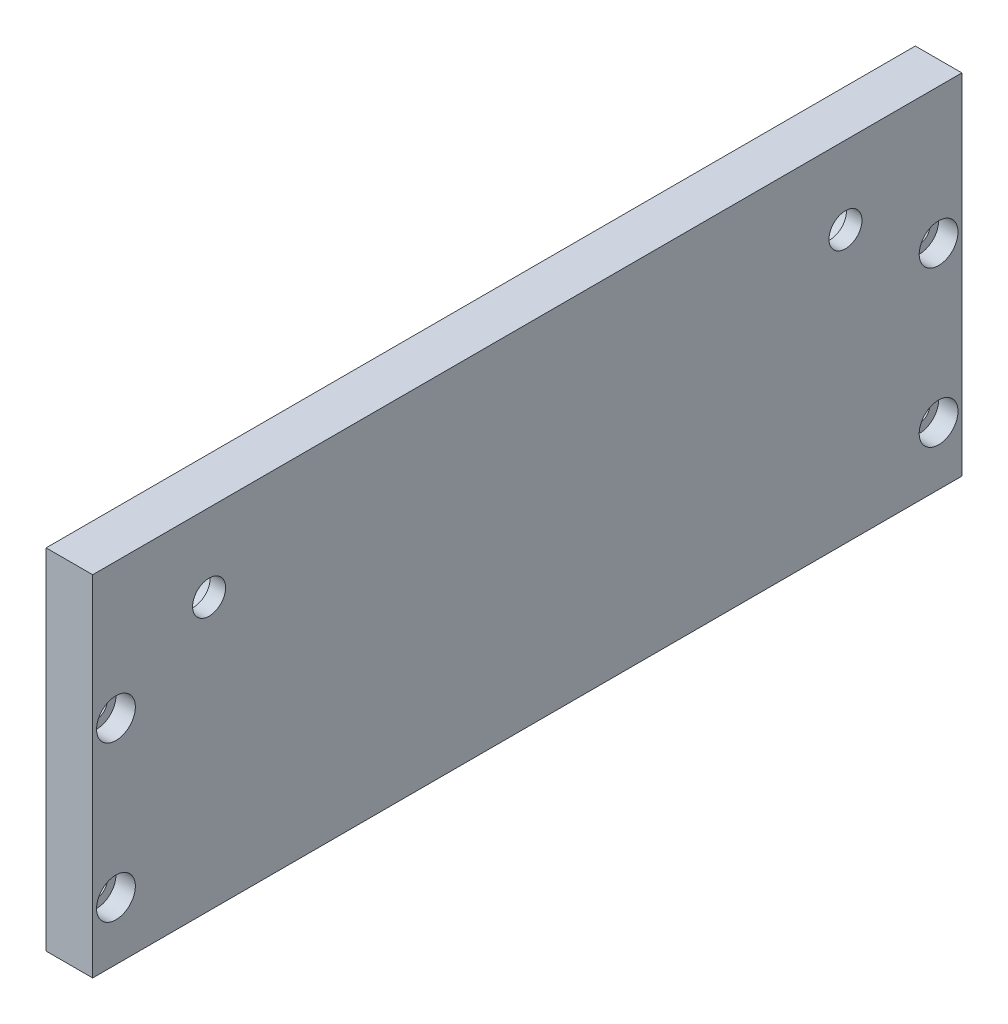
ISO-10303-21;
HEADER;
FILE_DESCRIPTION(('STEP AP214'),'2;1');
FILE_NAME('part.step','',(''),(''),'','','');
FILE_SCHEMA(('AUTOMOTIVE_DESIGN { 1 0 10303 214 1 1 1 1 }'));
ENDSEC;
DATA;
#1=APPLICATION_CONTEXT('core data for automotive mechanical design processes');
#2=APPLICATION_PROTOCOL_DEFINITION('international standard','automotive_design',2000,#1);
#3=PRODUCT_CONTEXT('',#1,'mechanical');
#4=PRODUCT('Part','Part','',(#3));
#5=PRODUCT_RELATED_PRODUCT_CATEGORY('part','',(#4));
#6=PRODUCT_DEFINITION_FORMATION('','',#4);
#7=PRODUCT_DEFINITION_CONTEXT('part definition',#1,'design');
#8=PRODUCT_DEFINITION('design','',#6,#7);
#9=PRODUCT_DEFINITION_SHAPE('','',#8);
#10=(LENGTH_UNIT() NAMED_UNIT(*) SI_UNIT(.MILLI.,.METRE.));
#11=(NAMED_UNIT(*) PLANE_ANGLE_UNIT() SI_UNIT($,.RADIAN.));
#12=(NAMED_UNIT(*) SI_UNIT($,.STERADIAN.) SOLID_ANGLE_UNIT());
#13=UNCERTAINTY_MEASURE_WITH_UNIT(LENGTH_MEASURE(1.E-05),#10,'distance_accuracy_value','');
#14=(GEOMETRIC_REPRESENTATION_CONTEXT(3) GLOBAL_UNCERTAINTY_ASSIGNED_CONTEXT((#13)) GLOBAL_UNIT_ASSIGNED_CONTEXT((#10,
#11,#12)) REPRESENTATION_CONTEXT('',''));
#15=CARTESIAN_POINT('',(0.,0.,0.));
#16=DIRECTION('',(0.,0.,1.));
#17=DIRECTION('',(1.,0.,0.));
#18=AXIS2_PLACEMENT_3D('',#15,#16,#17);
#19=CARTESIAN_POINT('',(7.,-30.,-106.));
#20=DIRECTION('',(1.,0.,0.));
#21=DIRECTION('',(0.,0.,-1.));
#22=AXIS2_PLACEMENT_3D('',#19,#20,#21);
#23=CYLINDRICAL_SURFACE('',#22,5.);
#24=CARTESIAN_POINT('',(12.,-30.,-106.));
#25=DIRECTION('',(1.,0.,0.));
#26=DIRECTION('',(0.,0.,-1.));
#27=AXIS2_PLACEMENT_3D('',#24,#25,#26);
#28=CIRCLE('',#27,5.);
#29=CARTESIAN_POINT('',(12.,-30.,-111.));
#30=VERTEX_POINT('',#29);
#31=EDGE_CURVE('E131',#30,#30,#28,.F.);
#32=ORIENTED_EDGE('',*,*,#31,.F.);
#33=EDGE_LOOP('',(#32));
#34=FACE_BOUND('',#33,.T.);
#35=CARTESIAN_POINT('',(7.,-30.,-106.));
#36=DIRECTION('',(1.,0.,0.));
#37=DIRECTION('',(0.,0.,-1.));
#38=AXIS2_PLACEMENT_3D('',#35,#36,#37);
#39=CIRCLE('',#38,5.);
#40=CARTESIAN_POINT('',(7.,-30.,-111.));
#41=VERTEX_POINT('',#40);
#42=EDGE_CURVE('E143',#41,#41,#39,.T.);
#43=ORIENTED_EDGE('',*,*,#42,.F.);
#44=EDGE_LOOP('',(#43));
#45=FACE_BOUND('',#44,.T.);
#46=ADVANCED_FACE('F17',(#34,#45),#23,.F.);
#47=CARTESIAN_POINT('',(7.,10.,-106.));
#48=DIRECTION('',(1.,0.,0.));
#49=DIRECTION('',(0.,0.,-1.));
#50=AXIS2_PLACEMENT_3D('',#47,#48,#49);
#51=CYLINDRICAL_SURFACE('',#50,5.);
#52=CARTESIAN_POINT('',(12.,10.,-106.));
#53=DIRECTION('',(1.,0.,0.));
#54=DIRECTION('',(0.,0.,-1.));
#55=AXIS2_PLACEMENT_3D('',#52,#53,#54);
#56=CIRCLE('',#55,5.);
#57=CARTESIAN_POINT('',(12.,10.,-111.));
#58=VERTEX_POINT('',#57);
#59=EDGE_CURVE('E128',#58,#58,#56,.F.);
#60=ORIENTED_EDGE('',*,*,#59,.F.);
#61=EDGE_LOOP('',(#60));
#62=FACE_BOUND('',#61,.T.);
#63=CARTESIAN_POINT('',(7.,10.,-106.));
#64=DIRECTION('',(1.,0.,0.));
#65=DIRECTION('',(0.,0.,-1.));
#66=AXIS2_PLACEMENT_3D('',#63,#64,#65);
#67=CIRCLE('',#66,5.);
#68=CARTESIAN_POINT('',(7.,10.,-111.));
#69=VERTEX_POINT('',#68);
#70=EDGE_CURVE('E145',#69,#69,#67,.T.);
#71=ORIENTED_EDGE('',*,*,#70,.F.);
#72=EDGE_LOOP('',(#71));
#73=FACE_BOUND('',#72,.T.);
#74=ADVANCED_FACE('F244',(#62,#73),#51,.F.);
#75=CARTESIAN_POINT('',(12.,25.,82.));
#76=DIRECTION('',(-1.,0.,0.));
#77=DIRECTION('',(0.,0.,1.));
#78=AXIS2_PLACEMENT_3D('',#75,#76,#77);
#79=CYLINDRICAL_SURFACE('',#78,4.25);
#80=CARTESIAN_POINT('',(8.,25.,82.));
#81=DIRECTION('',(-1.,0.,0.));
#82=DIRECTION('',(0.,0.,1.));
#83=AXIS2_PLACEMENT_3D('',#80,#81,#82);
#84=CIRCLE('',#83,4.25);
#85=CARTESIAN_POINT('',(8.,25.,86.25));
#86=VERTEX_POINT('',#85);
#87=EDGE_CURVE('E140',#86,#86,#84,.F.);
#88=ORIENTED_EDGE('',*,*,#87,.F.);
#89=EDGE_LOOP('',(#88));
#90=FACE_BOUND('',#89,.T.);
#91=CARTESIAN_POINT('',(12.,25.,82.));
#92=DIRECTION('',(-1.,0.,0.));
#93=DIRECTION('',(0.,0.,1.));
#94=AXIS2_PLACEMENT_3D('',#91,#92,#93);
#95=CIRCLE('',#94,4.25);
#96=CARTESIAN_POINT('',(12.,25.,86.25));
#97=VERTEX_POINT('',#96);
#98=EDGE_CURVE('E125',#97,#97,#95,.T.);
#99=ORIENTED_EDGE('',*,*,#98,.F.);
#100=EDGE_LOOP('',(#99));
#101=FACE_BOUND('',#100,.T.);
#102=ADVANCED_FACE('F241',(#90,#101),#79,.F.);
#103=CARTESIAN_POINT('',(12.,25.,-82.));
#104=DIRECTION('',(-1.,0.,0.));
#105=DIRECTION('',(0.,0.,1.));
#106=AXIS2_PLACEMENT_3D('',#103,#104,#105);
#107=CYLINDRICAL_SURFACE('',#106,4.25);
#108=CARTESIAN_POINT('',(8.,25.,-82.));
#109=DIRECTION('',(-1.,0.,0.));
#110=DIRECTION('',(0.,0.,1.));
#111=AXIS2_PLACEMENT_3D('',#108,#109,#110);
#112=CIRCLE('',#111,4.25);
#113=CARTESIAN_POINT('',(8.,25.,-77.75));
#114=VERTEX_POINT('',#113);
#115=EDGE_CURVE('E137',#114,#114,#112,.F.);
#116=ORIENTED_EDGE('',*,*,#115,.F.);
#117=EDGE_LOOP('',(#116));
#118=FACE_BOUND('',#117,.T.);
#119=CARTESIAN_POINT('',(12.,25.,-82.));
#120=DIRECTION('',(-1.,0.,0.));
#121=DIRECTION('',(0.,0.,1.));
#122=AXIS2_PLACEMENT_3D('',#119,#120,#121);
#123=CIRCLE('',#122,4.25);
#124=CARTESIAN_POINT('',(12.,25.,-77.75));
#125=VERTEX_POINT('',#124);
#126=EDGE_CURVE('E122',#125,#125,#123,.T.);
#127=ORIENTED_EDGE('',*,*,#126,.F.);
#128=EDGE_LOOP('',(#127));
#129=FACE_BOUND('',#128,.T.);
#130=ADVANCED_FACE('F159',(#118,#129),#107,.F.);
#131=CARTESIAN_POINT('',(7.,-30.,106.));
#132=DIRECTION('',(1.,0.,0.));
#133=DIRECTION('',(0.,0.,-1.));
#134=AXIS2_PLACEMENT_3D('',#131,#132,#133);
#135=CYLINDRICAL_SURFACE('',#134,5.);
#136=CARTESIAN_POINT('',(7.,-30.,106.));
#137=DIRECTION('',(1.,0.,0.));
#138=DIRECTION('',(0.,0.,-1.));
#139=AXIS2_PLACEMENT_3D('',#136,#137,#138);
#140=CIRCLE('',#139,5.);
#141=CARTESIAN_POINT('',(7.,-30.,101.));
#142=VERTEX_POINT('',#141);
#143=EDGE_CURVE('E20',#142,#142,#140,.T.);
#144=ORIENTED_EDGE('',*,*,#143,.F.);
#145=EDGE_LOOP('',(#144));
#146=FACE_BOUND('',#145,.T.);
#147=CARTESIAN_POINT('',(12.,-30.,106.));
#148=DIRECTION('',(1.,0.,0.));
#149=DIRECTION('',(0.,0.,-1.));
#150=AXIS2_PLACEMENT_3D('',#147,#148,#149);
#151=CIRCLE('',#150,5.);
#152=CARTESIAN_POINT('',(12.,-30.,101.));
#153=VERTEX_POINT('',#152);
#154=EDGE_CURVE('E119',#153,#153,#151,.F.);
#155=ORIENTED_EDGE('',*,*,#154,.F.);
#156=EDGE_LOOP('',(#155));
#157=FACE_BOUND('',#156,.T.);
#158=ADVANCED_FACE('F155',(#146,#157),#135,.F.);
#159=CARTESIAN_POINT('',(7.,10.,106.));
#160=DIRECTION('',(1.,0.,0.));
#161=DIRECTION('',(0.,0.,-1.));
#162=AXIS2_PLACEMENT_3D('',#159,#160,#161);
#163=CYLINDRICAL_SURFACE('',#162,5.);
#164=CARTESIAN_POINT('',(7.,10.,106.));
#165=DIRECTION('',(1.,0.,0.));
#166=DIRECTION('',(0.,0.,-1.));
#167=AXIS2_PLACEMENT_3D('',#164,#165,#166);
#168=CIRCLE('',#167,5.);
#169=CARTESIAN_POINT('',(7.,10.,101.));
#170=VERTEX_POINT('',#169);
#171=EDGE_CURVE('E116',#170,#170,#168,.T.);
#172=ORIENTED_EDGE('',*,*,#171,.F.);
#173=EDGE_LOOP('',(#172));
#174=FACE_BOUND('',#173,.T.);
#175=CARTESIAN_POINT('',(12.,10.,106.));
#176=DIRECTION('',(1.,0.,0.));
#177=DIRECTION('',(0.,0.,-1.));
#178=AXIS2_PLACEMENT_3D('',#175,#176,#177);
#179=CIRCLE('',#178,5.);
#180=CARTESIAN_POINT('',(12.,10.,101.));
#181=VERTEX_POINT('',#180);
#182=EDGE_CURVE('E134',#181,#181,#179,.F.);
#183=ORIENTED_EDGE('',*,*,#182,.F.);
#184=EDGE_LOOP('',(#183));
#185=FACE_BOUND('',#184,.T.);
#186=ADVANCED_FACE('F158',(#174,#185),#163,.F.);
#187=CARTESIAN_POINT('',(7.,-30.,106.));
#188=DIRECTION('',(1.,0.,0.));
#189=DIRECTION('',(0.,0.,-1.));
#190=AXIS2_PLACEMENT_3D('',#187,#188,#189);
#191=PLANE('',#190);
#192=ORIENTED_EDGE('',*,*,#143,.T.);
#193=EDGE_LOOP('',(#192));
#194=FACE_BOUND('',#193,.T.);
#195=CARTESIAN_POINT('',(7.,-30.,106.));
#196=DIRECTION('',(-1.,0.,0.));
#197=DIRECTION('',(0.,0.,1.));
#198=AXIS2_PLACEMENT_3D('',#195,#196,#197);
#199=CIRCLE('',#198,2.75);
#200=CARTESIAN_POINT('',(7.,-30.,108.75));
#201=VERTEX_POINT('',#200);
#202=EDGE_CURVE('E113',#201,#201,#199,.T.);
#203=ORIENTED_EDGE('',*,*,#202,.T.);
#204=EDGE_LOOP('',(#203));
#205=FACE_BOUND('',#204,.T.);
#206=ADVANCED_FACE('F152',(#194,#205),#191,.T.);
#207=CARTESIAN_POINT('',(7.,10.,-106.));
#208=DIRECTION('',(1.,0.,0.));
#209=DIRECTION('',(0.,0.,-1.));
#210=AXIS2_PLACEMENT_3D('',#207,#208,#209);
#211=PLANE('',#210);
#212=CARTESIAN_POINT('',(7.,10.,-106.));
#213=DIRECTION('',(-1.,0.,0.));
#214=DIRECTION('',(0.,0.,1.));
#215=AXIS2_PLACEMENT_3D('',#212,#213,#214);
#216=CIRCLE('',#215,2.75);
#217=CARTESIAN_POINT('',(7.,10.,-103.25));
#218=VERTEX_POINT('',#217);
#219=EDGE_CURVE('E110',#218,#218,#216,.T.);
#220=ORIENTED_EDGE('',*,*,#219,.T.);
#221=EDGE_LOOP('',(#220));
#222=FACE_BOUND('',#221,.T.);
#223=ORIENTED_EDGE('',*,*,#70,.T.);
#224=EDGE_LOOP('',(#223));
#225=FACE_BOUND('',#224,.T.);
#226=ADVANCED_FACE('F226',(#222,#225),#211,.T.);
#227=CARTESIAN_POINT('',(7.,-30.,-106.));
#228=DIRECTION('',(1.,0.,0.));
#229=DIRECTION('',(0.,0.,-1.));
#230=AXIS2_PLACEMENT_3D('',#227,#228,#229);
#231=PLANE('',#230);
#232=CARTESIAN_POINT('',(7.,-30.,-106.));
#233=DIRECTION('',(-1.,0.,0.));
#234=DIRECTION('',(0.,0.,1.));
#235=AXIS2_PLACEMENT_3D('',#232,#233,#234);
#236=CIRCLE('',#235,2.75);
#237=CARTESIAN_POINT('',(7.,-30.,-103.25));
#238=VERTEX_POINT('',#237);
#239=EDGE_CURVE('E107',#238,#238,#236,.T.);
#240=ORIENTED_EDGE('',*,*,#239,.T.);
#241=EDGE_LOOP('',(#240));
#242=FACE_BOUND('',#241,.T.);
#243=ORIENTED_EDGE('',*,*,#42,.T.);
#244=EDGE_LOOP('',(#243));
#245=FACE_BOUND('',#244,.T.);
#246=ADVANCED_FACE('F232',(#242,#245),#231,.T.);
#247=CARTESIAN_POINT('',(8.,25.,82.));
#248=DIRECTION('',(-1.,0.,0.));
#249=DIRECTION('',(0.,0.,1.));
#250=AXIS2_PLACEMENT_3D('',#247,#248,#249);
#251=PLANE('',#250);
#252=ORIENTED_EDGE('',*,*,#87,.T.);
#253=EDGE_LOOP('',(#252));
#254=FACE_BOUND('',#253,.T.);
#255=CARTESIAN_POINT('',(8.,25.,82.));
#256=DIRECTION('',(-1.,0.,0.));
#257=DIRECTION('',(0.,0.,1.));
#258=AXIS2_PLACEMENT_3D('',#255,#256,#257);
#259=CIRCLE('',#258,7.00000000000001);
#260=CARTESIAN_POINT('',(8.,25.,89.));
#261=VERTEX_POINT('',#260);
#262=EDGE_CURVE('E104',#261,#261,#259,.T.);
#263=ORIENTED_EDGE('',*,*,#262,.T.);
#264=EDGE_LOOP('',(#263));
#265=FACE_BOUND('',#264,.T.);
#266=ADVANCED_FACE('F175',(#254,#265),#251,.T.);
#267=CARTESIAN_POINT('',(8.,25.,-82.));
#268=DIRECTION('',(-1.,0.,0.));
#269=DIRECTION('',(0.,0.,1.));
#270=AXIS2_PLACEMENT_3D('',#267,#268,#269);
#271=PLANE('',#270);
#272=ORIENTED_EDGE('',*,*,#115,.T.);
#273=EDGE_LOOP('',(#272));
#274=FACE_BOUND('',#273,.T.);
#275=CARTESIAN_POINT('',(8.,25.,-82.));
#276=DIRECTION('',(-1.,0.,0.));
#277=DIRECTION('',(0.,0.,1.));
#278=AXIS2_PLACEMENT_3D('',#275,#276,#277);
#279=CIRCLE('',#278,7.00000000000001);
#280=CARTESIAN_POINT('',(8.,25.,-75.));
#281=VERTEX_POINT('',#280);
#282=EDGE_CURVE('E68',#281,#281,#279,.T.);
#283=ORIENTED_EDGE('',*,*,#282,.T.);
#284=EDGE_LOOP('',(#283));
#285=FACE_BOUND('',#284,.T.);
#286=ADVANCED_FACE('F165',(#274,#285),#271,.T.);
#287=CARTESIAN_POINT('',(12.,0.,0.));
#288=DIRECTION('',(1.,0.,0.));
#289=DIRECTION('',(0.,0.,-1.));
#290=AXIS2_PLACEMENT_3D('',#287,#288,#289);
#291=PLANE('',#290);
#292=ORIENTED_EDGE('',*,*,#154,.T.);
#293=EDGE_LOOP('',(#292));
#294=FACE_BOUND('',#293,.T.);
#295=DIRECTION('',(0.,1.,0.));
#296=VECTOR('',#295,1.);
#297=CARTESIAN_POINT('',(12.,45.,112.));
#298=LINE('',#297,#296);
#299=CARTESIAN_POINT('',(12.,45.,112.));
#300=VERTEX_POINT('',#299);
#301=CARTESIAN_POINT('',(12.,-45.,112.));
#302=VERTEX_POINT('',#301);
#303=EDGE_CURVE('E56',#300,#302,#298,.F.);
#304=ORIENTED_EDGE('',*,*,#303,.T.);
#305=DIRECTION('',(0.,0.,1.));
#306=VECTOR('',#305,1.);
#307=CARTESIAN_POINT('',(12.,-45.,112.));
#308=LINE('',#307,#306);
#309=CARTESIAN_POINT('',(12.,-45.,-112.));
#310=VERTEX_POINT('',#309);
#311=EDGE_CURVE('E440',#302,#310,#308,.F.);
#312=ORIENTED_EDGE('',*,*,#311,.T.);
#313=DIRECTION('',(0.,-1.,0.));
#314=VECTOR('',#313,1.);
#315=CARTESIAN_POINT('',(12.,45.,-112.));
#316=LINE('',#315,#314);
#317=CARTESIAN_POINT('',(12.,45.,-112.));
#318=VERTEX_POINT('',#317);
#319=EDGE_CURVE('E62',#310,#318,#316,.F.);
#320=ORIENTED_EDGE('',*,*,#319,.T.);
#321=DIRECTION('',(0.,0.,-1.));
#322=VECTOR('',#321,1.);
#323=CARTESIAN_POINT('',(12.,45.,112.));
#324=LINE('',#323,#322);
#325=EDGE_CURVE('E59',#318,#300,#324,.F.);
#326=ORIENTED_EDGE('',*,*,#325,.T.);
#327=EDGE_LOOP('',(#304,#312,#320,#326));
#328=FACE_BOUND('',#327,.T.);
#329=ORIENTED_EDGE('',*,*,#126,.T.);
#330=EDGE_LOOP('',(#329));
#331=FACE_BOUND('',#330,.T.);
#332=ORIENTED_EDGE('',*,*,#98,.T.);
#333=EDGE_LOOP('',(#332));
#334=FACE_BOUND('',#333,.T.);
#335=ORIENTED_EDGE('',*,*,#59,.T.);
#336=EDGE_LOOP('',(#335));
#337=FACE_BOUND('',#336,.T.);
#338=ORIENTED_EDGE('',*,*,#31,.T.);
#339=EDGE_LOOP('',(#338));
#340=FACE_BOUND('',#339,.T.);
#341=ORIENTED_EDGE('',*,*,#182,.T.);
#342=EDGE_LOOP('',(#341));
#343=FACE_BOUND('',#342,.T.);
#344=ADVANCED_FACE('F60',(#294,#328,#331,#334,#337,#340,#343),#291,.T.);
#345=CARTESIAN_POINT('',(7.,10.,106.));
#346=DIRECTION('',(1.,0.,0.));
#347=DIRECTION('',(0.,0.,-1.));
#348=AXIS2_PLACEMENT_3D('',#345,#346,#347);
#349=PLANE('',#348);
#350=ORIENTED_EDGE('',*,*,#171,.T.);
#351=EDGE_LOOP('',(#350));
#352=FACE_BOUND('',#351,.T.);
#353=CARTESIAN_POINT('',(7.,10.,106.));
#354=DIRECTION('',(-1.,0.,0.));
#355=DIRECTION('',(0.,0.,1.));
#356=AXIS2_PLACEMENT_3D('',#353,#354,#355);
#357=CIRCLE('',#356,2.75);
#358=CARTESIAN_POINT('',(7.,10.,108.75));
#359=VERTEX_POINT('',#358);
#360=EDGE_CURVE('E98',#359,#359,#357,.T.);
#361=ORIENTED_EDGE('',*,*,#360,.T.);
#362=EDGE_LOOP('',(#361));
#363=FACE_BOUND('',#362,.T.);
#364=ADVANCED_FACE('F164',(#352,#363),#349,.T.);
#365=CARTESIAN_POINT('',(12.,-30.,106.));
#366=DIRECTION('',(-1.,0.,0.));
#367=DIRECTION('',(0.,0.,1.));
#368=AXIS2_PLACEMENT_3D('',#365,#366,#367);
#369=CYLINDRICAL_SURFACE('',#368,2.75);
#370=CARTESIAN_POINT('',(0.,-30.,106.));
#371=DIRECTION('',(-1.,0.,0.));
#372=DIRECTION('',(0.,0.,1.));
#373=AXIS2_PLACEMENT_3D('',#370,#371,#372);
#374=CIRCLE('',#373,2.75);
#375=CARTESIAN_POINT('',(0.,-30.,108.75));
#376=VERTEX_POINT('',#375);
#377=EDGE_CURVE('E95',#376,#376,#374,.T.);
#378=ORIENTED_EDGE('',*,*,#377,.T.);
#379=EDGE_LOOP('',(#378));
#380=FACE_BOUND('',#379,.T.);
#381=ORIENTED_EDGE('',*,*,#202,.F.);
#382=EDGE_LOOP('',(#381));
#383=FACE_BOUND('',#382,.T.);
#384=ADVANCED_FACE('F172',(#380,#383),#369,.F.);
#385=CARTESIAN_POINT('',(12.,10.,-106.));
#386=DIRECTION('',(-1.,0.,0.));
#387=DIRECTION('',(0.,0.,1.));
#388=AXIS2_PLACEMENT_3D('',#385,#386,#387);
#389=CYLINDRICAL_SURFACE('',#388,2.75);
#390=ORIENTED_EDGE('',*,*,#219,.F.);
#391=EDGE_LOOP('',(#390));
#392=FACE_BOUND('',#391,.T.);
#393=CARTESIAN_POINT('',(0.,10.,-106.));
#394=DIRECTION('',(-1.,0.,0.));
#395=DIRECTION('',(0.,0.,1.));
#396=AXIS2_PLACEMENT_3D('',#393,#394,#395);
#397=CIRCLE('',#396,2.75);
#398=CARTESIAN_POINT('',(0.,10.,-103.25));
#399=VERTEX_POINT('',#398);
#400=EDGE_CURVE('E92',#399,#399,#397,.T.);
#401=ORIENTED_EDGE('',*,*,#400,.T.);
#402=EDGE_LOOP('',(#401));
#403=FACE_BOUND('',#402,.T.);
#404=ADVANCED_FACE('F213',(#392,#403),#389,.F.);
#405=CARTESIAN_POINT('',(12.,-30.,-106.));
#406=DIRECTION('',(-1.,0.,0.));
#407=DIRECTION('',(0.,0.,1.));
#408=AXIS2_PLACEMENT_3D('',#405,#406,#407);
#409=CYLINDRICAL_SURFACE('',#408,2.75);
#410=ORIENTED_EDGE('',*,*,#239,.F.);
#411=EDGE_LOOP('',(#410));
#412=FACE_BOUND('',#411,.T.);
#413=CARTESIAN_POINT('',(0.,-30.,-106.));
#414=DIRECTION('',(-1.,0.,0.));
#415=DIRECTION('',(0.,0.,1.));
#416=AXIS2_PLACEMENT_3D('',#413,#414,#415);
#417=CIRCLE('',#416,2.75);
#418=CARTESIAN_POINT('',(0.,-30.,-103.25));
#419=VERTEX_POINT('',#418);
#420=EDGE_CURVE('E89',#419,#419,#417,.T.);
#421=ORIENTED_EDGE('',*,*,#420,.T.);
#422=EDGE_LOOP('',(#421));
#423=FACE_BOUND('',#422,.T.);
#424=ADVANCED_FACE('F209',(#412,#423),#409,.F.);
#425=CARTESIAN_POINT('',(8.,25.,82.));
#426=DIRECTION('',(-1.,0.,0.));
#427=DIRECTION('',(0.,0.,1.));
#428=AXIS2_PLACEMENT_3D('',#425,#426,#427);
#429=CYLINDRICAL_SURFACE('',#428,7.00000000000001);
#430=ORIENTED_EDGE('',*,*,#262,.F.);
#431=EDGE_LOOP('',(#430));
#432=FACE_BOUND('',#431,.T.);
#433=CARTESIAN_POINT('',(0.,25.,82.));
#434=DIRECTION('',(-1.,0.,0.));
#435=DIRECTION('',(0.,0.,1.));
#436=AXIS2_PLACEMENT_3D('',#433,#434,#435);
#437=CIRCLE('',#436,7.00000000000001);
#438=CARTESIAN_POINT('',(0.,25.,89.));
#439=VERTEX_POINT('',#438);
#440=EDGE_CURVE('E86',#439,#439,#437,.T.);
#441=ORIENTED_EDGE('',*,*,#440,.T.);
#442=EDGE_LOOP('',(#441));
#443=FACE_BOUND('',#442,.T.);
#444=ADVANCED_FACE('F205',(#432,#443),#429,.F.);
#445=CARTESIAN_POINT('',(8.,25.,-82.));
#446=DIRECTION('',(-1.,0.,0.));
#447=DIRECTION('',(0.,0.,1.));
#448=AXIS2_PLACEMENT_3D('',#445,#446,#447);
#449=CYLINDRICAL_SURFACE('',#448,7.00000000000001);
#450=ORIENTED_EDGE('',*,*,#282,.F.);
#451=EDGE_LOOP('',(#450));
#452=FACE_BOUND('',#451,.T.);
#453=CARTESIAN_POINT('',(0.,25.,-82.));
#454=DIRECTION('',(-1.,0.,0.));
#455=DIRECTION('',(0.,0.,1.));
#456=AXIS2_PLACEMENT_3D('',#453,#454,#455);
#457=CIRCLE('',#456,7.00000000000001);
#458=CARTESIAN_POINT('',(0.,25.,-75.));
#459=VERTEX_POINT('',#458);
#460=EDGE_CURVE('E83',#459,#459,#457,.T.);
#461=ORIENTED_EDGE('',*,*,#460,.T.);
#462=EDGE_LOOP('',(#461));
#463=FACE_BOUND('',#462,.T.);
#464=ADVANCED_FACE('F202',(#452,#463),#449,.F.);
#465=CARTESIAN_POINT('',(12.,45.,112.));
#466=DIRECTION('',(0.,-1.,0.));
#467=DIRECTION('',(0.,0.,-1.));
#468=AXIS2_PLACEMENT_3D('',#465,#466,#467);
#469=PLANE('',#468);
#470=DIRECTION('',(1.,0.,0.));
#471=VECTOR('',#470,1.);
#472=CARTESIAN_POINT('',(12.,45.,112.));
#473=LINE('',#472,#471);
#474=CARTESIAN_POINT('',(0.,45.,112.));
#475=VERTEX_POINT('',#474);
#476=EDGE_CURVE('E67',#475,#300,#473,.T.);
#477=ORIENTED_EDGE('',*,*,#476,.T.);
#478=ORIENTED_EDGE('',*,*,#325,.F.);
#479=DIRECTION('',(1.,0.,0.));
#480=VECTOR('',#479,1.);
#481=CARTESIAN_POINT('',(12.,45.,-112.));
#482=LINE('',#481,#480);
#483=CARTESIAN_POINT('',(0.,45.,-112.));
#484=VERTEX_POINT('',#483);
#485=EDGE_CURVE('E101',#318,#484,#482,.F.);
#486=ORIENTED_EDGE('',*,*,#485,.T.);
#487=DIRECTION('',(0.,0.,-1.));
#488=VECTOR('',#487,1.);
#489=CARTESIAN_POINT('',(0.,45.,0.));
#490=LINE('',#489,#488);
#491=EDGE_CURVE('E79',#484,#475,#490,.F.);
#492=ORIENTED_EDGE('',*,*,#491,.T.);
#493=EDGE_LOOP('',(#477,#478,#486,#492));
#494=FACE_BOUND('',#493,.T.);
#495=ADVANCED_FACE('F78',(#494),#469,.F.);
#496=CARTESIAN_POINT('',(12.,45.,112.));
#497=DIRECTION('',(0.,0.,-1.));
#498=DIRECTION('',(0.,1.,0.));
#499=AXIS2_PLACEMENT_3D('',#496,#497,#498);
#500=PLANE('',#499);
#501=DIRECTION('',(1.,0.,0.));
#502=VECTOR('',#501,1.);
#503=CARTESIAN_POINT('',(12.,-45.,112.));
#504=LINE('',#503,#502);
#505=CARTESIAN_POINT('',(0.,-45.,112.));
#506=VERTEX_POINT('',#505);
#507=EDGE_CURVE('E75',#506,#302,#504,.T.);
#508=ORIENTED_EDGE('',*,*,#507,.T.);
#509=ORIENTED_EDGE('',*,*,#303,.F.);
#510=ORIENTED_EDGE('',*,*,#476,.F.);
#511=DIRECTION('',(0.,1.,0.));
#512=VECTOR('',#511,1.);
#513=CARTESIAN_POINT('',(0.,0.,112.));
#514=LINE('',#513,#512);
#515=EDGE_CURVE('E449',#475,#506,#514,.F.);
#516=ORIENTED_EDGE('',*,*,#515,.T.);
#517=EDGE_LOOP('',(#508,#509,#510,#516));
#518=FACE_BOUND('',#517,.T.);
#519=ADVANCED_FACE('F72',(#518),#500,.F.);
#520=CARTESIAN_POINT('',(12.,-45.,112.));
#521=DIRECTION('',(0.,1.,0.));
#522=DIRECTION('',(0.,0.,1.));
#523=AXIS2_PLACEMENT_3D('',#520,#521,#522);
#524=PLANE('',#523);
#525=DIRECTION('',(1.,0.,0.));
#526=VECTOR('',#525,1.);
#527=CARTESIAN_POINT('',(12.,-45.,-112.));
#528=LINE('',#527,#526);
#529=CARTESIAN_POINT('',(0.,-45.,-112.));
#530=VERTEX_POINT('',#529);
#531=EDGE_CURVE('E35',#530,#310,#528,.T.);
#532=ORIENTED_EDGE('',*,*,#531,.T.);
#533=ORIENTED_EDGE('',*,*,#311,.F.);
#534=ORIENTED_EDGE('',*,*,#507,.F.);
#535=DIRECTION('',(0.,0.,-1.));
#536=VECTOR('',#535,1.);
#537=CARTESIAN_POINT('',(0.,-45.,0.));
#538=LINE('',#537,#536);
#539=EDGE_CURVE('E442',#506,#530,#538,.T.);
#540=ORIENTED_EDGE('',*,*,#539,.T.);
#541=EDGE_LOOP('',(#532,#533,#534,#540));
#542=FACE_BOUND('',#541,.T.);
#543=ADVANCED_FACE('F194',(#542),#524,.F.);
#544=CARTESIAN_POINT('',(12.,45.,-112.));
#545=DIRECTION('',(0.,0.,1.));
#546=DIRECTION('',(0.,-1.,0.));
#547=AXIS2_PLACEMENT_3D('',#544,#545,#546);
#548=PLANE('',#547);
#549=ORIENTED_EDGE('',*,*,#485,.F.);
#550=ORIENTED_EDGE('',*,*,#319,.F.);
#551=ORIENTED_EDGE('',*,*,#531,.F.);
#552=DIRECTION('',(0.,1.,0.));
#553=VECTOR('',#552,1.);
#554=CARTESIAN_POINT('',(0.,0.,-112.));
#555=LINE('',#554,#553);
#556=EDGE_CURVE('E26',#530,#484,#555,.T.);
#557=ORIENTED_EDGE('',*,*,#556,.T.);
#558=EDGE_LOOP('',(#549,#550,#551,#557));
#559=FACE_BOUND('',#558,.T.);
#560=ADVANCED_FACE('F186',(#559),#548,.F.);
#561=CARTESIAN_POINT('',(12.,10.,106.));
#562=DIRECTION('',(-1.,0.,0.));
#563=DIRECTION('',(0.,0.,1.));
#564=AXIS2_PLACEMENT_3D('',#561,#562,#563);
#565=CYLINDRICAL_SURFACE('',#564,2.75);
#566=CARTESIAN_POINT('',(0.,10.,106.));
#567=DIRECTION('',(-1.,0.,0.));
#568=DIRECTION('',(0.,0.,1.));
#569=AXIS2_PLACEMENT_3D('',#566,#567,#568);
#570=CIRCLE('',#569,2.75);
#571=CARTESIAN_POINT('',(0.,10.,108.75));
#572=VERTEX_POINT('',#571);
#573=EDGE_CURVE('E11',#572,#572,#570,.T.);
#574=ORIENTED_EDGE('',*,*,#573,.T.);
#575=EDGE_LOOP('',(#574));
#576=FACE_BOUND('',#575,.T.);
#577=ORIENTED_EDGE('',*,*,#360,.F.);
#578=EDGE_LOOP('',(#577));
#579=FACE_BOUND('',#578,.T.);
#580=ADVANCED_FACE('F180',(#576,#579),#565,.F.);
#581=CARTESIAN_POINT('',(0.,0.,0.));
#582=DIRECTION('',(1.,0.,0.));
#583=DIRECTION('',(0.,0.,-1.));
#584=AXIS2_PLACEMENT_3D('',#581,#582,#583);
#585=PLANE('',#584);
#586=ORIENTED_EDGE('',*,*,#573,.F.);
#587=EDGE_LOOP('',(#586));
#588=FACE_BOUND('',#587,.T.);
#589=ORIENTED_EDGE('',*,*,#539,.F.);
#590=ORIENTED_EDGE('',*,*,#515,.F.);
#591=ORIENTED_EDGE('',*,*,#491,.F.);
#592=ORIENTED_EDGE('',*,*,#556,.F.);
#593=EDGE_LOOP('',(#589,#590,#591,#592));
#594=FACE_BOUND('',#593,.T.);
#595=ORIENTED_EDGE('',*,*,#460,.F.);
#596=EDGE_LOOP('',(#595));
#597=FACE_BOUND('',#596,.T.);
#598=ORIENTED_EDGE('',*,*,#440,.F.);
#599=EDGE_LOOP('',(#598));
#600=FACE_BOUND('',#599,.T.);
#601=ORIENTED_EDGE('',*,*,#420,.F.);
#602=EDGE_LOOP('',(#601));
#603=FACE_BOUND('',#602,.T.);
#604=ORIENTED_EDGE('',*,*,#400,.F.);
#605=EDGE_LOOP('',(#604));
#606=FACE_BOUND('',#605,.T.);
#607=ORIENTED_EDGE('',*,*,#377,.F.);
#608=EDGE_LOOP('',(#607));
#609=FACE_BOUND('',#608,.T.);
#610=ADVANCED_FACE('F178',(#588,#594,#597,#600,#603,#606,#609),#585,.F.);
#611=CLOSED_SHELL('',(#46,#74,#102,#130,#158,#186,#206,#226,#246,#266,#286,#344,#364,#384,#404,
#424,#444,#464,#495,#519,#543,#560,#580,#610));
#612=MANIFOLD_SOLID_BREP('B1',#611);
#613=ADVANCED_BREP_SHAPE_REPRESENTATION('',(#18,#612),#14);
#614=SHAPE_DEFINITION_REPRESENTATION(#9,#613);
ENDSEC;
END-ISO-10303-21;
